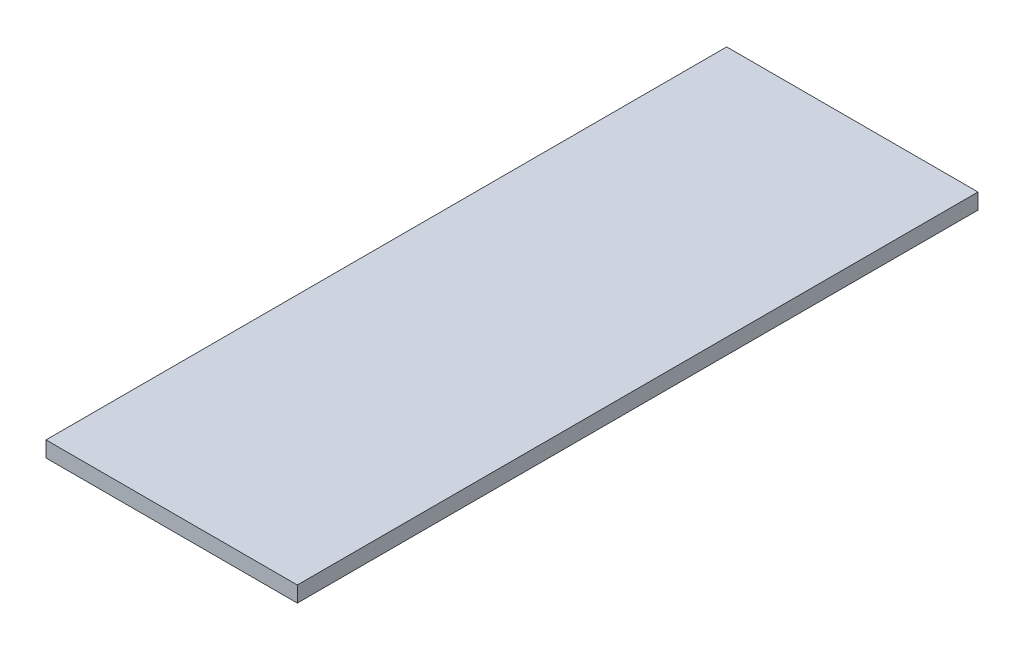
ISO-10303-21;
HEADER;
FILE_DESCRIPTION(('STEP AP214'),'2;1');
FILE_NAME('part.step','',(''),(''),'','','');
FILE_SCHEMA(('AUTOMOTIVE_DESIGN { 1 0 10303 214 1 1 1 1 }'));
ENDSEC;
DATA;
#1=APPLICATION_CONTEXT('core data for automotive mechanical design processes');
#2=APPLICATION_PROTOCOL_DEFINITION('international standard','automotive_design',2000,#1);
#3=PRODUCT_CONTEXT('',#1,'mechanical');
#4=PRODUCT('Part','Part','',(#3));
#5=PRODUCT_RELATED_PRODUCT_CATEGORY('part','',(#4));
#6=PRODUCT_DEFINITION_FORMATION('','',#4);
#7=PRODUCT_DEFINITION_CONTEXT('part definition',#1,'design');
#8=PRODUCT_DEFINITION('design','',#6,#7);
#9=PRODUCT_DEFINITION_SHAPE('','',#8);
#10=(LENGTH_UNIT() NAMED_UNIT(*) SI_UNIT(.MILLI.,.METRE.));
#11=(NAMED_UNIT(*) PLANE_ANGLE_UNIT() SI_UNIT($,.RADIAN.));
#12=(NAMED_UNIT(*) SI_UNIT($,.STERADIAN.) SOLID_ANGLE_UNIT());
#13=UNCERTAINTY_MEASURE_WITH_UNIT(LENGTH_MEASURE(1.E-05),#10,'distance_accuracy_value','');
#14=(GEOMETRIC_REPRESENTATION_CONTEXT(3) GLOBAL_UNCERTAINTY_ASSIGNED_CONTEXT((#13)) GLOBAL_UNIT_ASSIGNED_CONTEXT((#10,
#11,#12)) REPRESENTATION_CONTEXT('',''));
#15=CARTESIAN_POINT('',(0.,0.,0.));
#16=DIRECTION('',(0.,0.,1.));
#17=DIRECTION('',(1.,0.,0.));
#18=AXIS2_PLACEMENT_3D('',#15,#16,#17);
#19=CARTESIAN_POINT('',(-24.,95.,58.0936586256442));
#20=DIRECTION('',(0.,-1.,0.));
#21=DIRECTION('',(0.,0.,-1.));
#22=AXIS2_PLACEMENT_3D('',#19,#20,#21);
#23=PLANE('',#22);
#24=DIRECTION('',(0.,0.,-1.));
#25=VECTOR('',#24,1.);
#26=CARTESIAN_POINT('',(-24.,95.,58.0936586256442));
#27=LINE('',#26,#25);
#28=CARTESIAN_POINT('',(-24.,95.,10.));
#29=VERTEX_POINT('',#28);
#30=CARTESIAN_POINT('',(-24.,95.,-120.));
#31=VERTEX_POINT('',#30);
#32=EDGE_CURVE('E99',#29,#31,#27,.T.);
#33=ORIENTED_EDGE('',*,*,#32,.F.);
#34=DIRECTION('',(1.,0.,0.));
#35=VECTOR('',#34,1.);
#36=CARTESIAN_POINT('',(-24.,95.,10.));
#37=LINE('',#36,#35);
#38=CARTESIAN_POINT('',(24.,95.,10.));
#39=VERTEX_POINT('',#38);
#40=EDGE_CURVE('E37',#29,#39,#37,.T.);
#41=ORIENTED_EDGE('',*,*,#40,.T.);
#42=DIRECTION('',(0.,0.,-1.));
#43=VECTOR('',#42,1.);
#44=CARTESIAN_POINT('',(24.,95.,58.0936586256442));
#45=LINE('',#44,#43);
#46=CARTESIAN_POINT('',(24.,95.,-120.));
#47=VERTEX_POINT('',#46);
#48=EDGE_CURVE('E81',#39,#47,#45,.T.);
#49=ORIENTED_EDGE('',*,*,#48,.T.);
#50=DIRECTION('',(-1.,0.,0.));
#51=VECTOR('',#50,1.);
#52=CARTESIAN_POINT('',(-24.,95.,-120.));
#53=LINE('',#52,#51);
#54=EDGE_CURVE('E91',#47,#31,#53,.T.);
#55=ORIENTED_EDGE('',*,*,#54,.T.);
#56=EDGE_LOOP('',(#33,#41,#49,#55));
#57=FACE_BOUND('',#56,.T.);
#58=ADVANCED_FACE('F33',(#57),#23,.F.);
#59=CARTESIAN_POINT('',(24.,92.,58.0936586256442));
#60=DIRECTION('',(-1.,0.,0.));
#61=DIRECTION('',(0.,0.,1.));
#62=AXIS2_PLACEMENT_3D('',#59,#60,#61);
#63=PLANE('',#62);
#64=ORIENTED_EDGE('',*,*,#48,.F.);
#65=DIRECTION('',(0.,-1.,0.));
#66=VECTOR('',#65,1.);
#67=CARTESIAN_POINT('',(24.,92.,10.));
#68=LINE('',#67,#66);
#69=CARTESIAN_POINT('',(24.,92.,10.));
#70=VERTEX_POINT('',#69);
#71=EDGE_CURVE('E77',#39,#70,#68,.T.);
#72=ORIENTED_EDGE('',*,*,#71,.T.);
#73=DIRECTION('',(0.,0.,-1.));
#74=VECTOR('',#73,1.);
#75=CARTESIAN_POINT('',(24.,92.,58.0936586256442));
#76=LINE('',#75,#74);
#77=CARTESIAN_POINT('',(24.,92.,-120.));
#78=VERTEX_POINT('',#77);
#79=EDGE_CURVE('E72',#70,#78,#76,.T.);
#80=ORIENTED_EDGE('',*,*,#79,.T.);
#81=DIRECTION('',(0.,1.,0.));
#82=VECTOR('',#81,1.);
#83=CARTESIAN_POINT('',(24.,92.,-120.));
#84=LINE('',#83,#82);
#85=EDGE_CURVE('E76',#78,#47,#84,.T.);
#86=ORIENTED_EDGE('',*,*,#85,.T.);
#87=EDGE_LOOP('',(#64,#72,#80,#86));
#88=FACE_BOUND('',#87,.T.);
#89=ADVANCED_FACE('F75',(#88),#63,.F.);
#90=CARTESIAN_POINT('',(-24.,92.,58.0936586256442));
#91=DIRECTION('',(0.,1.,0.));
#92=DIRECTION('',(0.,0.,1.));
#93=AXIS2_PLACEMENT_3D('',#90,#91,#92);
#94=PLANE('',#93);
#95=ORIENTED_EDGE('',*,*,#79,.F.);
#96=DIRECTION('',(-1.,0.,0.));
#97=VECTOR('',#96,1.);
#98=CARTESIAN_POINT('',(-24.,92.,10.));
#99=LINE('',#98,#97);
#100=CARTESIAN_POINT('',(-24.,92.,10.));
#101=VERTEX_POINT('',#100);
#102=EDGE_CURVE('E42',#70,#101,#99,.T.);
#103=ORIENTED_EDGE('',*,*,#102,.T.);
#104=DIRECTION('',(0.,0.,-1.));
#105=VECTOR('',#104,1.);
#106=CARTESIAN_POINT('',(-24.,92.,58.0936586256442));
#107=LINE('',#106,#105);
#108=CARTESIAN_POINT('',(-24.,92.,-120.));
#109=VERTEX_POINT('',#108);
#110=EDGE_CURVE('E80',#101,#109,#107,.T.);
#111=ORIENTED_EDGE('',*,*,#110,.T.);
#112=DIRECTION('',(1.,0.,0.));
#113=VECTOR('',#112,1.);
#114=CARTESIAN_POINT('',(-24.,92.,-120.));
#115=LINE('',#114,#113);
#116=EDGE_CURVE('E88',#109,#78,#115,.T.);
#117=ORIENTED_EDGE('',*,*,#116,.T.);
#118=EDGE_LOOP('',(#95,#103,#111,#117));
#119=FACE_BOUND('',#118,.T.);
#120=ADVANCED_FACE('F93',(#119),#94,.F.);
#121=CARTESIAN_POINT('',(-24.,92.,58.0936586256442));
#122=DIRECTION('',(1.,0.,0.));
#123=DIRECTION('',(0.,0.,-1.));
#124=AXIS2_PLACEMENT_3D('',#121,#122,#123);
#125=PLANE('',#124);
#126=ORIENTED_EDGE('',*,*,#110,.F.);
#127=DIRECTION('',(0.,1.,0.));
#128=VECTOR('',#127,1.);
#129=CARTESIAN_POINT('',(-24.,92.,10.));
#130=LINE('',#129,#128);
#131=EDGE_CURVE('E11',#101,#29,#130,.T.);
#132=ORIENTED_EDGE('',*,*,#131,.T.);
#133=ORIENTED_EDGE('',*,*,#32,.T.);
#134=DIRECTION('',(0.,-1.,0.));
#135=VECTOR('',#134,1.);
#136=CARTESIAN_POINT('',(-24.,92.,-120.));
#137=LINE('',#136,#135);
#138=EDGE_CURVE('E97',#31,#109,#137,.T.);
#139=ORIENTED_EDGE('',*,*,#138,.T.);
#140=EDGE_LOOP('',(#126,#132,#133,#139));
#141=FACE_BOUND('',#140,.T.);
#142=ADVANCED_FACE('F35',(#141),#125,.F.);
#143=CARTESIAN_POINT('',(0.,0.,10.));
#144=DIRECTION('',(0.,0.,-1.));
#145=DIRECTION('',(-1.,0.,0.));
#146=AXIS2_PLACEMENT_3D('',#143,#144,#145);
#147=PLANE('',#146);
#148=ORIENTED_EDGE('',*,*,#102,.F.);
#149=ORIENTED_EDGE('',*,*,#71,.F.);
#150=ORIENTED_EDGE('',*,*,#40,.F.);
#151=ORIENTED_EDGE('',*,*,#131,.F.);
#152=EDGE_LOOP('',(#148,#149,#150,#151));
#153=FACE_BOUND('',#152,.T.);
#154=ADVANCED_FACE('F107',(#153),#147,.F.);
#155=CARTESIAN_POINT('',(0.,0.,-120.));
#156=DIRECTION('',(0.,0.,-1.));
#157=DIRECTION('',(-1.,0.,0.));
#158=AXIS2_PLACEMENT_3D('',#155,#156,#157);
#159=PLANE('',#158);
#160=ORIENTED_EDGE('',*,*,#138,.F.);
#161=ORIENTED_EDGE('',*,*,#54,.F.);
#162=ORIENTED_EDGE('',*,*,#85,.F.);
#163=ORIENTED_EDGE('',*,*,#116,.F.);
#164=EDGE_LOOP('',(#160,#161,#162,#163));
#165=FACE_BOUND('',#164,.T.);
#166=ADVANCED_FACE('F87',(#165),#159,.T.);
#167=CLOSED_SHELL('',(#58,#89,#120,#142,#154,#166));
#168=MANIFOLD_SOLID_BREP('B2',#167);
#169=ADVANCED_BREP_SHAPE_REPRESENTATION('',(#18,#168),#14);
#170=SHAPE_DEFINITION_REPRESENTATION(#9,#169);
ENDSEC;
END-ISO-10303-21;
